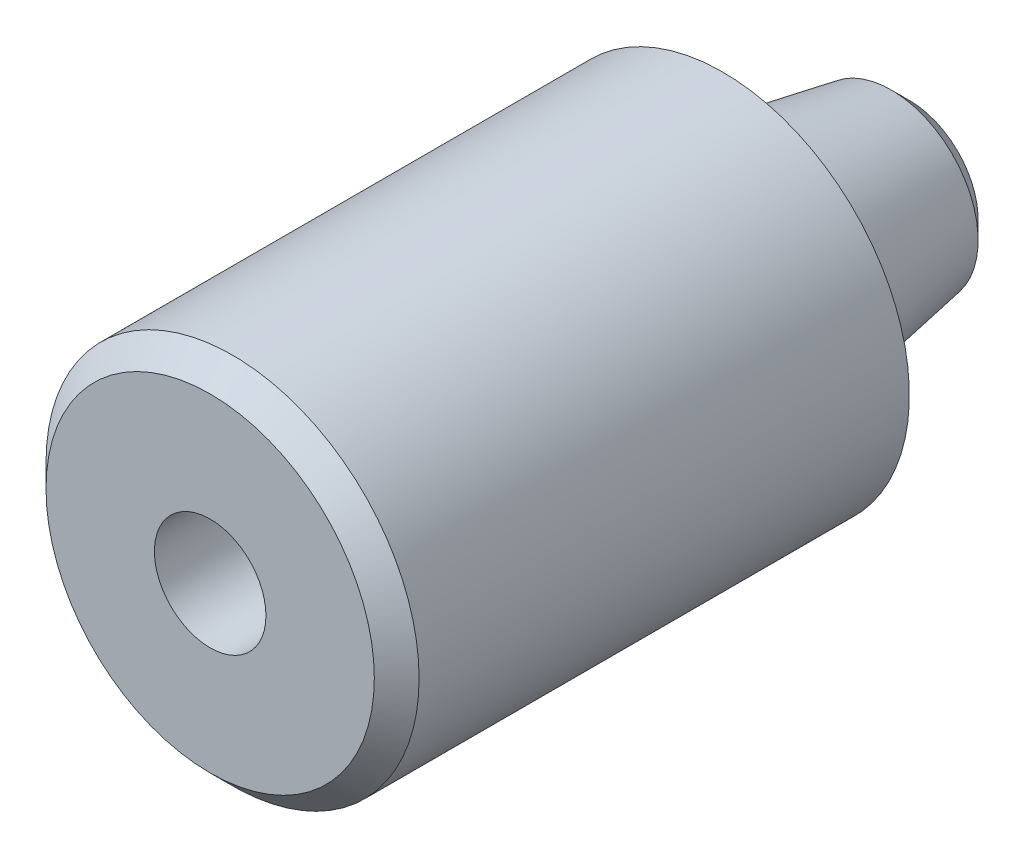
ISO-10303-21;
HEADER;
FILE_DESCRIPTION(('STEP AP214'),'2;1');
FILE_NAME('part.step','',(''),(''),'','','');
FILE_SCHEMA(('AUTOMOTIVE_DESIGN { 1 0 10303 214 1 1 1 1 }'));
ENDSEC;
DATA;
#1=APPLICATION_CONTEXT('core data for automotive mechanical design processes');
#2=APPLICATION_PROTOCOL_DEFINITION('international standard','automotive_design',2000,#1);
#3=PRODUCT_CONTEXT('',#1,'mechanical');
#4=PRODUCT('Part','Part','',(#3));
#5=PRODUCT_RELATED_PRODUCT_CATEGORY('part','',(#4));
#6=PRODUCT_DEFINITION_FORMATION('','',#4);
#7=PRODUCT_DEFINITION_CONTEXT('part definition',#1,'design');
#8=PRODUCT_DEFINITION('design','',#6,#7);
#9=PRODUCT_DEFINITION_SHAPE('','',#8);
#10=(LENGTH_UNIT() NAMED_UNIT(*) SI_UNIT(.MILLI.,.METRE.));
#11=(NAMED_UNIT(*) PLANE_ANGLE_UNIT() SI_UNIT($,.RADIAN.));
#12=(NAMED_UNIT(*) SI_UNIT($,.STERADIAN.) SOLID_ANGLE_UNIT());
#13=UNCERTAINTY_MEASURE_WITH_UNIT(LENGTH_MEASURE(1.E-05),#10,'distance_accuracy_value','');
#14=(GEOMETRIC_REPRESENTATION_CONTEXT(3) GLOBAL_UNCERTAINTY_ASSIGNED_CONTEXT((#13)) GLOBAL_UNIT_ASSIGNED_CONTEXT((#10,
#11,#12)) REPRESENTATION_CONTEXT('',''));
#15=CARTESIAN_POINT('',(0.,0.,0.));
#16=DIRECTION('',(0.,0.,1.));
#17=DIRECTION('',(1.,0.,0.));
#18=AXIS2_PLACEMENT_3D('',#15,#16,#17);
#19=CARTESIAN_POINT('',(0.,0.,0.));
#20=DIRECTION('',(0.,0.,1.));
#21=DIRECTION('',(1.,0.,0.));
#22=AXIS2_PLACEMENT_3D('',#19,#20,#21);
#23=PLANE('',#22);
#24=CARTESIAN_POINT('',(0.,0.,0.));
#25=DIRECTION('',(0.,0.,1.));
#26=DIRECTION('',(1.,0.,0.));
#27=AXIS2_PLACEMENT_3D('',#24,#25,#26);
#28=CIRCLE('',#27,1.89865);
#29=CARTESIAN_POINT('',(1.89865,0.,0.));
#30=VERTEX_POINT('',#29);
#31=EDGE_CURVE('E56',#30,#30,#28,.T.);
#32=ORIENTED_EDGE('',*,*,#31,.F.);
#33=EDGE_LOOP('',(#32));
#34=FACE_BOUND('',#33,.T.);
#35=CARTESIAN_POINT('',(0.,0.,0.));
#36=DIRECTION('',(0.,0.,1.));
#37=DIRECTION('',(1.,0.,0.));
#38=AXIS2_PLACEMENT_3D('',#35,#36,#37);
#39=CIRCLE('',#38,5.58799999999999);
#40=CARTESIAN_POINT('',(5.58799999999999,0.,0.));
#41=VERTEX_POINT('',#40);
#42=EDGE_CURVE('E69',#41,#41,#39,.T.);
#43=ORIENTED_EDGE('',*,*,#42,.T.);
#44=EDGE_LOOP('',(#43));
#45=FACE_BOUND('',#44,.T.);
#46=ADVANCED_FACE('F36',(#34,#45),#23,.T.);
#47=CARTESIAN_POINT('',(0.,0.,0.));
#48=DIRECTION('',(0.,0.,-1.));
#49=DIRECTION('',(-1.,0.,0.));
#50=AXIS2_PLACEMENT_3D('',#47,#48,#49);
#51=CYLINDRICAL_SURFACE('',#50,6.35);
#52=CARTESIAN_POINT('',(0.,0.,-0.762000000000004));
#53=DIRECTION('',(0.,0.,1.));
#54=DIRECTION('',(1.,0.,0.));
#55=AXIS2_PLACEMENT_3D('',#52,#53,#54);
#56=CIRCLE('',#55,6.35);
#57=CARTESIAN_POINT('',(6.35,0.,-0.762000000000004));
#58=VERTEX_POINT('',#57);
#59=EDGE_CURVE('E66',#58,#58,#56,.F.);
#60=ORIENTED_EDGE('',*,*,#59,.T.);
#61=EDGE_LOOP('',(#60));
#62=FACE_BOUND('',#61,.T.);
#63=CARTESIAN_POINT('',(0.,0.,-17.4498));
#64=DIRECTION('',(0.,0.,-1.));
#65=DIRECTION('',(-1.,0.,0.));
#66=AXIS2_PLACEMENT_3D('',#63,#64,#65);
#67=CIRCLE('',#66,6.35);
#68=CARTESIAN_POINT('',(-6.35,0.,-17.4498));
#69=VERTEX_POINT('',#68);
#70=EDGE_CURVE('E59',#69,#69,#67,.T.);
#71=ORIENTED_EDGE('',*,*,#70,.F.);
#72=EDGE_LOOP('',(#71));
#73=FACE_BOUND('',#72,.T.);
#74=ADVANCED_FACE('F85',(#62,#73),#51,.T.);
#75=CARTESIAN_POINT('',(0.,6.35,-17.4498));
#76=DIRECTION('',(0.,0.,-1.));
#77=DIRECTION('',(-1.,0.,0.));
#78=AXIS2_PLACEMENT_3D('',#75,#76,#77);
#79=PLANE('',#78);
#80=ORIENTED_EDGE('',*,*,#70,.T.);
#81=EDGE_LOOP('',(#80));
#82=FACE_BOUND('',#81,.T.);
#83=CARTESIAN_POINT('',(0.,0.,-17.4498));
#84=DIRECTION('',(0.,0.,-1.));
#85=DIRECTION('',(-1.,0.,0.));
#86=AXIS2_PLACEMENT_3D('',#83,#84,#85);
#87=CIRCLE('',#86,3.96875);
#88=CARTESIAN_POINT('',(-3.96875,0.,-17.4498));
#89=VERTEX_POINT('',#88);
#90=EDGE_CURVE('E55',#89,#89,#87,.T.);
#91=ORIENTED_EDGE('',*,*,#90,.F.);
#92=EDGE_LOOP('',(#91));
#93=FACE_BOUND('',#92,.T.);
#94=ADVANCED_FACE('F91',(#82,#93),#79,.T.);
#95=CARTESIAN_POINT('',(0.,0.,-23.7998));
#96=DIRECTION('',(0.,0.,1.));
#97=DIRECTION('',(1.,0.,0.));
#98=AXIS2_PLACEMENT_3D('',#95,#96,#97);
#99=CONICAL_SURFACE('',#98,2.84907367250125,0.174532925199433);
#100=CARTESIAN_POINT('',(0.,0.,-23.1830504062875));
#101=DIRECTION('',(0.,0.,-1.));
#102=DIRECTION('',(-1.,0.,0.));
#103=AXIS2_PLACEMENT_3D('',#100,#101,#102);
#104=CIRCLE('',#103,2.95782326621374);
#105=CARTESIAN_POINT('',(-2.95782326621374,0.,-23.1830504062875));
#106=VERTEX_POINT('',#105);
#107=EDGE_CURVE('E11',#106,#106,#104,.F.);
#108=ORIENTED_EDGE('',*,*,#107,.T.);
#109=EDGE_LOOP('',(#108));
#110=FACE_BOUND('',#109,.T.);
#111=ORIENTED_EDGE('',*,*,#90,.T.);
#112=EDGE_LOOP('',(#111));
#113=FACE_BOUND('',#112,.T.);
#114=ADVANCED_FACE('F99',(#110,#113),#99,.T.);
#115=CARTESIAN_POINT('',(0.,2.84907367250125,-23.7998));
#116=DIRECTION('',(0.,0.,-1.));
#117=DIRECTION('',(-1.,0.,0.));
#118=AXIS2_PLACEMENT_3D('',#115,#116,#117);
#119=PLANE('',#118);
#120=CARTESIAN_POINT('',(0.,0.,-23.7998));
#121=DIRECTION('',(0.,0.,-1.));
#122=DIRECTION('',(-1.,0.,0.));
#123=AXIS2_PLACEMENT_3D('',#120,#121,#122);
#124=CIRCLE('',#123,2.34107367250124);
#125=CARTESIAN_POINT('',(-2.34107367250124,0.,-23.7998));
#126=VERTEX_POINT('',#125);
#127=EDGE_CURVE('E43',#126,#126,#124,.T.);
#128=ORIENTED_EDGE('',*,*,#127,.T.);
#129=EDGE_LOOP('',(#128));
#130=FACE_BOUND('',#129,.T.);
#131=ADVANCED_FACE('F74',(#130),#119,.T.);
#132=CARTESIAN_POINT('',(0.,0.,-0.762000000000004));
#133=DIRECTION('',(0.,0.,-1.));
#134=DIRECTION('',(-1.,0.,0.));
#135=AXIS2_PLACEMENT_3D('',#132,#133,#134);
#136=CONICAL_SURFACE('',#135,6.35,0.78539816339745);
#137=ORIENTED_EDGE('',*,*,#42,.F.);
#138=EDGE_LOOP('',(#137));
#139=FACE_BOUND('',#138,.T.);
#140=ORIENTED_EDGE('',*,*,#59,.F.);
#141=EDGE_LOOP('',(#140));
#142=FACE_BOUND('',#141,.T.);
#143=ADVANCED_FACE('F77',(#139,#142),#136,.T.);
#144=CARTESIAN_POINT('',(0.,0.,-23.7998));
#145=DIRECTION('',(0.,0.,1.));
#146=DIRECTION('',(1.,0.,0.));
#147=AXIS2_PLACEMENT_3D('',#144,#145,#146);
#148=CONICAL_SURFACE('',#147,2.34107367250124,0.785398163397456);
#149=ORIENTED_EDGE('',*,*,#107,.F.);
#150=EDGE_LOOP('',(#149));
#151=FACE_BOUND('',#150,.T.);
#152=ORIENTED_EDGE('',*,*,#127,.F.);
#153=EDGE_LOOP('',(#152));
#154=FACE_BOUND('',#153,.T.);
#155=ADVANCED_FACE('F38',(#151,#154),#148,.T.);
#156=CARTESIAN_POINT('',(0.,0.,-12.7));
#157=DIRECTION('',(0.,0.,1.));
#158=DIRECTION('',(1.,0.,0.));
#159=AXIS2_PLACEMENT_3D('',#156,#157,#158);
#160=CONICAL_SURFACE('',#159,1.89865,1.02974425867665);
#161=CARTESIAN_POINT('',(0.,0.,-13.8408240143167));
#162=VERTEX_POINT('',#161);
#163=VERTEX_LOOP('',#162);
#164=FACE_BOUND('',#163,.T.);
#165=CARTESIAN_POINT('',(0.,0.,-12.7));
#166=DIRECTION('',(0.,0.,1.));
#167=DIRECTION('',(1.,0.,0.));
#168=AXIS2_PLACEMENT_3D('',#165,#166,#167);
#169=CIRCLE('',#168,1.89865);
#170=CARTESIAN_POINT('',(1.89865,0.,-12.7));
#171=VERTEX_POINT('',#170);
#172=EDGE_CURVE('E53',#171,#171,#169,.T.);
#173=ORIENTED_EDGE('',*,*,#172,.T.);
#174=EDGE_LOOP('',(#173));
#175=FACE_BOUND('',#174,.T.);
#176=ADVANCED_FACE('F46',(#164,#175),#160,.F.);
#177=CARTESIAN_POINT('',(0.,0.,0.));
#178=DIRECTION('',(0.,0.,1.));
#179=DIRECTION('',(1.,0.,0.));
#180=AXIS2_PLACEMENT_3D('',#177,#178,#179);
#181=CYLINDRICAL_SURFACE('',#180,1.89865);
#182=ORIENTED_EDGE('',*,*,#172,.F.);
#183=EDGE_LOOP('',(#182));
#184=FACE_BOUND('',#183,.T.);
#185=ORIENTED_EDGE('',*,*,#31,.T.);
#186=EDGE_LOOP('',(#185));
#187=FACE_BOUND('',#186,.T.);
#188=ADVANCED_FACE('F49',(#184,#187),#181,.F.);
#189=CLOSED_SHELL('',(#46,#74,#94,#114,#131,#143,#155,#176,#188));
#190=MANIFOLD_SOLID_BREP('B2',#189);
#191=ADVANCED_BREP_SHAPE_REPRESENTATION('',(#18,#190),#14);
#192=SHAPE_DEFINITION_REPRESENTATION(#9,#191);
ENDSEC;
END-ISO-10303-21;
